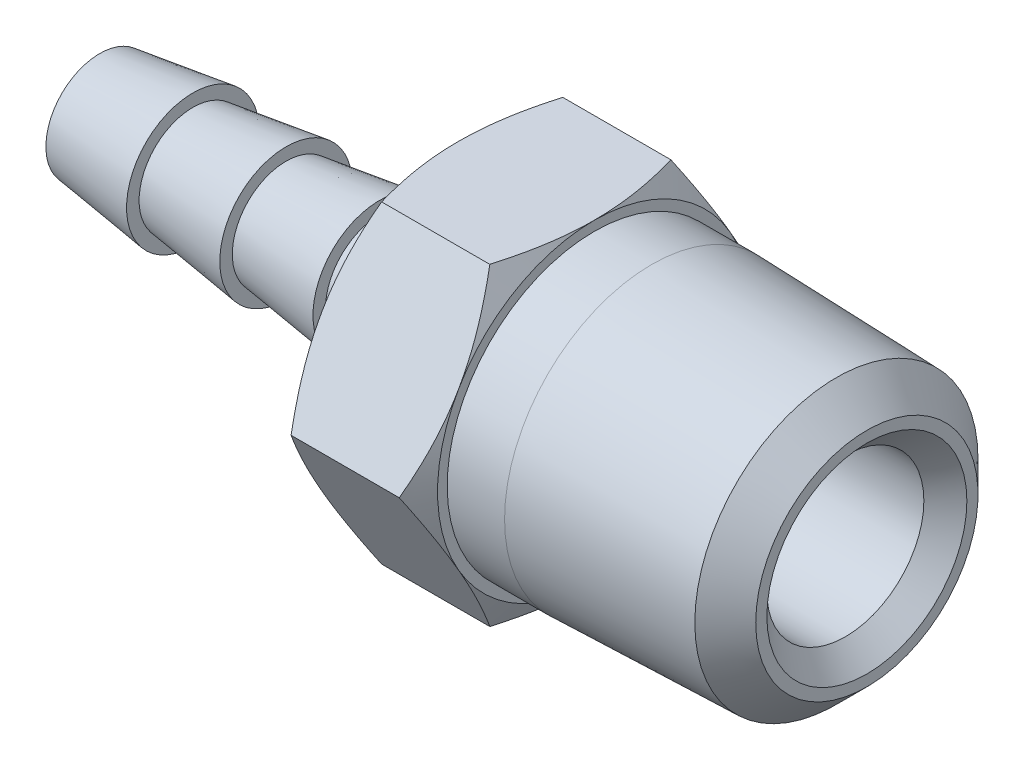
ISO-10303-21;
HEADER;
FILE_DESCRIPTION(('STEP AP214'),'2;1');
FILE_NAME('part.step','',(''),(''),'','','');
FILE_SCHEMA(('AUTOMOTIVE_DESIGN { 1 0 10303 214 1 1 1 1 }'));
ENDSEC;
DATA;
#1=APPLICATION_CONTEXT('core data for automotive mechanical design processes');
#2=APPLICATION_PROTOCOL_DEFINITION('international standard','automotive_design',2000,#1);
#3=PRODUCT_CONTEXT('',#1,'mechanical');
#4=PRODUCT('Part','Part','',(#3));
#5=PRODUCT_RELATED_PRODUCT_CATEGORY('part','',(#4));
#6=PRODUCT_DEFINITION_FORMATION('','',#4);
#7=PRODUCT_DEFINITION_CONTEXT('part definition',#1,'design');
#8=PRODUCT_DEFINITION('design','',#6,#7);
#9=PRODUCT_DEFINITION_SHAPE('','',#8);
#10=(LENGTH_UNIT() NAMED_UNIT(*) SI_UNIT(.MILLI.,.METRE.));
#11=(NAMED_UNIT(*) PLANE_ANGLE_UNIT() SI_UNIT($,.RADIAN.));
#12=(NAMED_UNIT(*) SI_UNIT($,.STERADIAN.) SOLID_ANGLE_UNIT());
#13=UNCERTAINTY_MEASURE_WITH_UNIT(LENGTH_MEASURE(1.E-05),#10,'distance_accuracy_value','');
#14=(GEOMETRIC_REPRESENTATION_CONTEXT(3) GLOBAL_UNCERTAINTY_ASSIGNED_CONTEXT((#13)) GLOBAL_UNIT_ASSIGNED_CONTEXT((#10,
#11,#12)) REPRESENTATION_CONTEXT('',''));
#15=CARTESIAN_POINT('',(0.,0.,0.));
#16=DIRECTION('',(0.,0.,1.));
#17=DIRECTION('',(1.,0.,0.));
#18=AXIS2_PLACEMENT_3D('',#15,#16,#17);
#19=CARTESIAN_POINT('',(6.60399999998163,0.,0.));
#20=DIRECTION('',(1.,0.,0.));
#21=DIRECTION('',(0.,0.,-1.));
#22=AXIS2_PLACEMENT_3D('',#19,#20,#21);
#23=CONICAL_SURFACE('',#22,2.34949999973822,0.133810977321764);
#24=CARTESIAN_POINT('',(3.30199999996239,0.,0.));
#25=DIRECTION('',(1.,0.,0.));
#26=DIRECTION('',(0.,0.,-1.));
#27=AXIS2_PLACEMENT_3D('',#24,#25,#26);
#28=CIRCLE('',#27,1.9050000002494);
#29=CARTESIAN_POINT('',(3.30199999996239,0.,-1.9050000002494));
#30=VERTEX_POINT('',#29);
#31=EDGE_CURVE('E499',#30,#30,#28,.F.);
#32=ORIENTED_EDGE('',*,*,#31,.F.);
#33=EDGE_LOOP('',(#32));
#34=FACE_BOUND('',#33,.T.);
#35=CARTESIAN_POINT('',(6.60400000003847,0.,0.));
#36=DIRECTION('',(1.,0.,0.));
#37=DIRECTION('',(0.,0.,-1.));
#38=AXIS2_PLACEMENT_3D('',#35,#36,#37);
#39=CIRCLE('',#38,2.34949999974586);
#40=CARTESIAN_POINT('',(6.60400000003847,0.,-2.34949999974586));
#41=VERTEX_POINT('',#40);
#42=EDGE_CURVE('E18',#41,#41,#39,.T.);
#43=ORIENTED_EDGE('',*,*,#42,.F.);
#44=EDGE_LOOP('',(#43));
#45=FACE_BOUND('',#44,.T.);
#46=ADVANCED_FACE('F14',(#34,#45),#23,.T.);
#47=CARTESIAN_POINT('',(6.604,0.,1.17475));
#48=DIRECTION('',(1.,0.,0.));
#49=DIRECTION('',(0.,0.,-1.));
#50=AXIS2_PLACEMENT_3D('',#47,#48,#49);
#51=PLANE('',#50);
#52=CARTESIAN_POINT('',(6.60399999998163,0.,0.));
#53=DIRECTION('',(1.,0.,0.));
#54=DIRECTION('',(0.,0.,-1.));
#55=AXIS2_PLACEMENT_3D('',#52,#53,#54);
#56=CIRCLE('',#55,1.90500000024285);
#57=CARTESIAN_POINT('',(6.60399999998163,0.,-1.90500000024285));
#58=VERTEX_POINT('',#57);
#59=EDGE_CURVE('E497',#58,#58,#56,.T.);
#60=ORIENTED_EDGE('',*,*,#59,.F.);
#61=EDGE_LOOP('',(#60));
#62=FACE_BOUND('',#61,.T.);
#63=ORIENTED_EDGE('',*,*,#42,.T.);
#64=EDGE_LOOP('',(#63));
#65=FACE_BOUND('',#64,.T.);
#66=ADVANCED_FACE('F506',(#62,#65),#51,.T.);
#67=CARTESIAN_POINT('',(3.302,0.,1.17475));
#68=DIRECTION('',(1.,0.,0.));
#69=DIRECTION('',(0.,0.,-1.));
#70=AXIS2_PLACEMENT_3D('',#67,#68,#69);
#71=PLANE('',#70);
#72=ORIENTED_EDGE('',*,*,#31,.T.);
#73=EDGE_LOOP('',(#72));
#74=FACE_BOUND('',#73,.T.);
#75=CARTESIAN_POINT('',(3.30200000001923,0.,0.));
#76=DIRECTION('',(1.,0.,0.));
#77=DIRECTION('',(0.,0.,-1.));
#78=AXIS2_PLACEMENT_3D('',#75,#76,#77);
#79=CIRCLE('',#78,2.34949999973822);
#80=CARTESIAN_POINT('',(3.30200000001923,0.,-2.34949999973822));
#81=VERTEX_POINT('',#80);
#82=EDGE_CURVE('E494',#81,#81,#79,.F.);
#83=ORIENTED_EDGE('',*,*,#82,.F.);
#84=EDGE_LOOP('',(#83));
#85=FACE_BOUND('',#84,.T.);
#86=ADVANCED_FACE('F515',(#74,#85),#71,.T.);
#87=CARTESIAN_POINT('',(9.90600000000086,0.,0.));
#88=DIRECTION('',(1.,0.,0.));
#89=DIRECTION('',(0.,0.,-1.));
#90=AXIS2_PLACEMENT_3D('',#87,#88,#89);
#91=CONICAL_SURFACE('',#90,2.34949999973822,0.133810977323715);
#92=ORIENTED_EDGE('',*,*,#59,.T.);
#93=EDGE_LOOP('',(#92));
#94=FACE_BOUND('',#93,.T.);
#95=CARTESIAN_POINT('',(9.9060000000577,0.,0.));
#96=DIRECTION('',(1.,0.,0.));
#97=DIRECTION('',(0.,0.,-1.));
#98=AXIS2_PLACEMENT_3D('',#95,#96,#97);
#99=CIRCLE('',#98,2.34949999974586);
#100=CARTESIAN_POINT('',(9.9060000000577,0.,-2.34949999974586));
#101=VERTEX_POINT('',#100);
#102=EDGE_CURVE('E491',#101,#101,#99,.T.);
#103=ORIENTED_EDGE('',*,*,#102,.F.);
#104=EDGE_LOOP('',(#103));
#105=FACE_BOUND('',#104,.T.);
#106=ADVANCED_FACE('F679',(#94,#105),#91,.T.);
#107=CARTESIAN_POINT('',(3.30200000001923,0.,0.));
#108=DIRECTION('',(1.,0.,0.));
#109=DIRECTION('',(0.,0.,-1.));
#110=AXIS2_PLACEMENT_3D('',#107,#108,#109);
#111=CONICAL_SURFACE('',#110,2.34949999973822,0.133810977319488);
#112=CARTESIAN_POINT('',(-5.6843418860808E-11,0.,0.));
#113=DIRECTION('',(1.,0.,0.));
#114=DIRECTION('',(0.,0.,-1.));
#115=AXIS2_PLACEMENT_3D('',#112,#113,#114);
#116=CIRCLE('',#115,1.9050000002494);
#117=CARTESIAN_POINT('',(-5.6843418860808E-11,0.,-1.9050000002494));
#118=VERTEX_POINT('',#117);
#119=EDGE_CURVE('E488',#118,#118,#116,.F.);
#120=ORIENTED_EDGE('',*,*,#119,.F.);
#121=EDGE_LOOP('',(#120));
#122=FACE_BOUND('',#121,.T.);
#123=ORIENTED_EDGE('',*,*,#82,.T.);
#124=EDGE_LOOP('',(#123));
#125=FACE_BOUND('',#124,.T.);
#126=ADVANCED_FACE('F669',(#122,#125),#111,.T.);
#127=CARTESIAN_POINT('',(9.906,0.,1.17475));
#128=DIRECTION('',(1.,0.,0.));
#129=DIRECTION('',(0.,0.,-1.));
#130=AXIS2_PLACEMENT_3D('',#127,#128,#129);
#131=PLANE('',#130);
#132=CARTESIAN_POINT('',(9.90599999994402,0.,0.));
#133=DIRECTION('',(1.,0.,0.));
#134=DIRECTION('',(0.,0.,-1.));
#135=AXIS2_PLACEMENT_3D('',#132,#133,#134);
#136=CIRCLE('',#135,1.90500000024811);
#137=CARTESIAN_POINT('',(9.90599999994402,0.,-1.90500000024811));
#138=VERTEX_POINT('',#137);
#139=EDGE_CURVE('E485',#138,#138,#136,.T.);
#140=ORIENTED_EDGE('',*,*,#139,.F.);
#141=EDGE_LOOP('',(#140));
#142=FACE_BOUND('',#141,.T.);
#143=ORIENTED_EDGE('',*,*,#102,.T.);
#144=EDGE_LOOP('',(#143));
#145=FACE_BOUND('',#144,.T.);
#146=ADVANCED_FACE('F657',(#142,#145),#131,.T.);
#147=CARTESIAN_POINT('',(0.,0.,0.9525));
#148=DIRECTION('',(-1.,0.,0.));
#149=DIRECTION('',(0.,0.,1.));
#150=AXIS2_PLACEMENT_3D('',#147,#148,#149);
#151=PLANE('',#150);
#152=CARTESIAN_POINT('',(0.,0.,0.));
#153=DIRECTION('',(1.,0.,0.));
#154=DIRECTION('',(0.,0.,-1.));
#155=AXIS2_PLACEMENT_3D('',#152,#153,#154);
#156=CIRCLE('',#155,1.1811);
#157=CARTESIAN_POINT('',(0.,0.,-1.1811));
#158=VERTEX_POINT('',#157);
#159=EDGE_CURVE('E482',#158,#158,#156,.T.);
#160=ORIENTED_EDGE('',*,*,#159,.T.);
#161=EDGE_LOOP('',(#160));
#162=FACE_BOUND('',#161,.T.);
#163=ORIENTED_EDGE('',*,*,#119,.T.);
#164=EDGE_LOOP('',(#163));
#165=FACE_BOUND('',#164,.T.);
#166=ADVANCED_FACE('F644',(#162,#165),#151,.T.);
#167=CARTESIAN_POINT('',(12.6999999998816,0.,0.));
#168=DIRECTION('',(1.,0.,0.));
#169=DIRECTION('',(0.,0.,-1.));
#170=AXIS2_PLACEMENT_3D('',#167,#168,#169);
#171=CONICAL_SURFACE('',#170,2.34949999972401,0.157768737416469);
#172=CARTESIAN_POINT('',(12.7000000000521,0.,0.));
#173=DIRECTION('',(1.,0.,0.));
#174=DIRECTION('',(0.,0.,-1.));
#175=AXIS2_PLACEMENT_3D('',#172,#173,#174);
#176=CIRCLE('',#175,2.34949999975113);
#177=CARTESIAN_POINT('',(12.7000000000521,0.,-2.34949999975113));
#178=VERTEX_POINT('',#177);
#179=EDGE_CURVE('E359',#178,#178,#176,.F.);
#180=ORIENTED_EDGE('',*,*,#179,.T.);
#181=EDGE_LOOP('',(#180));
#182=FACE_BOUND('',#181,.T.);
#183=ORIENTED_EDGE('',*,*,#139,.T.);
#184=EDGE_LOOP('',(#183));
#185=FACE_BOUND('',#184,.T.);
#186=ADVANCED_FACE('F522',(#182,#185),#171,.T.);
#187=CARTESIAN_POINT('',(0.,0.,0.));
#188=DIRECTION('',(1.,0.,0.));
#189=DIRECTION('',(0.,0.,-1.));
#190=AXIS2_PLACEMENT_3D('',#187,#188,#189);
#191=CYLINDRICAL_SURFACE('',#190,1.1811);
#192=ORIENTED_EDGE('',*,*,#159,.F.);
#193=EDGE_LOOP('',(#192));
#194=FACE_BOUND('',#193,.T.);
#195=CARTESIAN_POINT('',(13.5165028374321,0.,0.));
#196=DIRECTION('',(1.,0.,0.));
#197=DIRECTION('',(0.,0.,-1.));
#198=AXIS2_PLACEMENT_3D('',#195,#196,#197);
#199=CIRCLE('',#198,1.1811);
#200=CARTESIAN_POINT('',(13.5165028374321,0.,-1.1811));
#201=VERTEX_POINT('',#200);
#202=EDGE_CURVE('E130',#201,#201,#199,.T.);
#203=ORIENTED_EDGE('',*,*,#202,.T.);
#204=EDGE_LOOP('',(#203));
#205=FACE_BOUND('',#204,.T.);
#206=ADVANCED_FACE('F520',(#194,#205),#191,.F.);
#207=CARTESIAN_POINT('',(12.7,0.,0.));
#208=DIRECTION('',(1.,0.,0.));
#209=DIRECTION('',(0.,0.,-1.));
#210=AXIS2_PLACEMENT_3D('',#207,#208,#209);
#211=PLANE('',#210);
#212=ORIENTED_EDGE('',*,*,#179,.F.);
#213=EDGE_LOOP('',(#212));
#214=FACE_BOUND('',#213,.T.);
#215=CARTESIAN_POINT('',(12.6999999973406,0.,0.));
#216=DIRECTION('',(1.,0.,0.));
#217=DIRECTION('',(0.,0.,-1.));
#218=AXIS2_PLACEMENT_3D('',#215,#216,#217);
#219=CIRCLE('',#218,5.55625000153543);
#220=CARTESIAN_POINT('',(12.6999999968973,-2.77812500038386,-4.81185365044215));
#221=VERTEX_POINT('',#220);
#222=CARTESIAN_POINT('',(12.6999999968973,2.77812500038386,-4.81185365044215));
#223=VERTEX_POINT('',#222);
#224=EDGE_CURVE('E463',#221,#223,#219,.T.);
#225=ORIENTED_EDGE('',*,*,#224,.F.);
#226=CARTESIAN_POINT('',(12.6999999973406,0.,0.));
#227=DIRECTION('',(1.,0.,0.));
#228=DIRECTION('',(0.,0.,-1.));
#229=AXIS2_PLACEMENT_3D('',#226,#227,#228);
#230=CIRCLE('',#229,5.55625000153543);
#231=CARTESIAN_POINT('',(12.6999999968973,-5.55625000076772,0.));
#232=VERTEX_POINT('',#231);
#233=EDGE_CURVE('E465',#232,#221,#230,.T.);
#234=ORIENTED_EDGE('',*,*,#233,.F.);
#235=CARTESIAN_POINT('',(12.6999999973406,0.,0.));
#236=DIRECTION('',(1.,0.,0.));
#237=DIRECTION('',(0.,0.,-1.));
#238=AXIS2_PLACEMENT_3D('',#235,#236,#237);
#239=CIRCLE('',#238,5.55625000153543);
#240=CARTESIAN_POINT('',(12.6999999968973,-2.77812500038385,4.81185365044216));
#241=VERTEX_POINT('',#240);
#242=EDGE_CURVE('E108',#241,#232,#239,.T.);
#243=ORIENTED_EDGE('',*,*,#242,.F.);
#244=CARTESIAN_POINT('',(12.6999999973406,0.,0.));
#245=DIRECTION('',(1.,0.,0.));
#246=DIRECTION('',(0.,0.,-1.));
#247=AXIS2_PLACEMENT_3D('',#244,#245,#246);
#248=CIRCLE('',#247,5.55625000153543);
#249=CARTESIAN_POINT('',(12.6999999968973,2.77812500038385,4.81185365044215));
#250=VERTEX_POINT('',#249);
#251=EDGE_CURVE('E104',#250,#241,#248,.T.);
#252=ORIENTED_EDGE('',*,*,#251,.F.);
#253=CARTESIAN_POINT('',(12.6999999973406,0.,0.));
#254=DIRECTION('',(1.,0.,0.));
#255=DIRECTION('',(0.,0.,-1.));
#256=AXIS2_PLACEMENT_3D('',#253,#254,#255);
#257=CIRCLE('',#256,5.55625000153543);
#258=CARTESIAN_POINT('',(12.6999999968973,5.55625000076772,0.));
#259=VERTEX_POINT('',#258);
#260=EDGE_CURVE('E101',#259,#250,#257,.T.);
#261=ORIENTED_EDGE('',*,*,#260,.F.);
#262=CARTESIAN_POINT('',(12.6999999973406,0.,0.));
#263=DIRECTION('',(1.,0.,0.));
#264=DIRECTION('',(0.,0.,-1.));
#265=AXIS2_PLACEMENT_3D('',#262,#263,#264);
#266=CIRCLE('',#265,5.55625000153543);
#267=EDGE_CURVE('E356',#223,#259,#266,.T.);
#268=ORIENTED_EDGE('',*,*,#267,.F.);
#269=EDGE_LOOP('',(#225,#234,#243,#252,#261,#268));
#270=FACE_BOUND('',#269,.T.);
#271=ADVANCED_FACE('F106',(#214,#270),#211,.F.);
#272=CARTESIAN_POINT('',(14.478,0.,0.));
#273=DIRECTION('',(1.,0.,0.));
#274=DIRECTION('',(0.,0.,-1.));
#275=AXIS2_PLACEMENT_3D('',#272,#273,#274);
#276=CONICAL_SURFACE('',#275,2.7813,1.02974425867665);
#277=CARTESIAN_POINT('',(14.478,0.,0.));
#278=DIRECTION('',(1.,0.,0.));
#279=DIRECTION('',(0.,0.,-1.));
#280=AXIS2_PLACEMENT_3D('',#277,#278,#279);
#281=CIRCLE('',#280,2.7813);
#282=CARTESIAN_POINT('',(14.478,0.,-2.7813));
#283=VERTEX_POINT('',#282);
#284=EDGE_CURVE('E353',#283,#283,#281,.T.);
#285=ORIENTED_EDGE('',*,*,#284,.T.);
#286=EDGE_LOOP('',(#285));
#287=FACE_BOUND('',#286,.T.);
#288=ORIENTED_EDGE('',*,*,#202,.F.);
#289=EDGE_LOOP('',(#288));
#290=FACE_BOUND('',#289,.T.);
#291=ADVANCED_FACE('F161',(#287,#290),#276,.F.);
#292=CARTESIAN_POINT('',(13.199241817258,0.,0.));
#293=DIRECTION('',(1.,0.,0.));
#294=DIRECTION('',(0.,0.,-1.));
#295=AXIS2_PLACEMENT_3D('',#292,#293,#294);
#296=CONICAL_SURFACE('',#295,6.42096219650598,1.04719755);
#297=CARTESIAN_POINT('',(12.6999999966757,5.55624999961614,0.));
#298=CARTESIAN_POINT('',(12.6999772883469,5.55624999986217,0.136157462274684));
#299=CARTESIAN_POINT('',(12.7028890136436,5.55624999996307,0.27230836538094));
#300=CARTESIAN_POINT('',(12.714412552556,5.55625000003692,0.544342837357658));
#301=CARTESIAN_POINT('',(12.7230232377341,5.55625000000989,0.68022645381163));
#302=CARTESIAN_POINT('',(12.7457192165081,5.55624999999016,0.950848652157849));
#303=CARTESIAN_POINT('',(12.7597769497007,5.55624999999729,1.08558956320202));
#304=CARTESIAN_POINT('',(12.7930646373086,5.55625000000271,1.35442943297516));
#305=CARTESIAN_POINT('',(12.8122947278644,5.55625000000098,1.48852837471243));
#306=CARTESIAN_POINT('',(12.8771494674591,5.55624999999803,1.88930639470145));
#307=CARTESIAN_POINT('',(12.9299700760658,5.55624999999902,2.1548211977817));
#308=CARTESIAN_POINT('',(13.0517879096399,5.55625000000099,2.68356749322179));
#309=CARTESIAN_POINT('',(13.120865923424,5.55625000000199,2.94678054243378));
#310=CARTESIAN_POINT('',(13.1962642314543,5.55625,3.2079024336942));
#311=B_SPLINE_CURVE_WITH_KNOTS('',3,(#297,#298,#299,#300,#301,#302,#303,#304,#305,#306,#307,
#308,#309,#310),.UNSPECIFIED.,.F.,.F.,(4,2,2,2,2,2,4),(0.,0.408430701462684,0.816780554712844,
1.22309070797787,1.62941155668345,2.44098829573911,3.25668653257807),.UNSPECIFIED.);
#312=CARTESIAN_POINT('',(13.1962642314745,5.55625000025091,3.20790243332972));
#313=VERTEX_POINT('',#312);
#314=EDGE_CURVE('E121',#259,#313,#311,.T.);
#315=ORIENTED_EDGE('',*,*,#314,.F.);
#316=ORIENTED_EDGE('',*,*,#260,.T.);
#317=CARTESIAN_POINT('',(13.1962642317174,5.55625000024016,3.20790243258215));
#318=CARTESIAN_POINT('',(13.1208659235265,5.33011180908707,3.3384633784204));
#319=CARTESIAN_POINT('',(13.0517879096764,5.10216262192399,3.47006990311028));
#320=CARTESIAN_POINT('',(12.9299700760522,4.64425489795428,3.73444305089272));
#321=CARTESIAN_POINT('',(12.8771494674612,4.41431233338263,3.86720045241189));
#322=CARTESIAN_POINT('',(12.8122947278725,4.06722838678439,4.06758946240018));
#323=CARTESIAN_POINT('',(12.793064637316,3.95109529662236,4.13463893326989));
#324=CARTESIAN_POINT('',(12.7597769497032,3.71827313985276,4.2690588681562));
#325=CARTESIAN_POINT('',(12.7457192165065,3.60158408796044,4.33642932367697));
#326=CARTESIAN_POINT('',(12.7230232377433,3.36721838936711,4.47174042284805));
#327=CARTESIAN_POINT('',(12.7144125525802,3.24953972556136,4.53968223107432));
#328=CARTESIAN_POINT('',(12.7028890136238,3.01395096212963,4.67569946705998));
#329=CARTESIAN_POINT('',(12.699977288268,2.89604082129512,4.74377491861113));
#330=CARTESIAN_POINT('',(12.6999999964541,2.7781250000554,4.8118536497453));
#331=B_SPLINE_CURVE_WITH_KNOTS('',3,(#317,#318,#319,#320,#321,#322,#323,#324,#325,#326,#327,
#328,#329,#330),.UNSPECIFIED.,.F.,.F.,(4,2,2,2,2,2,4),(0.,0.815698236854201,1.62727497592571,
2.03359582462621,2.4399059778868,2.84825583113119,3.2566865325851),.UNSPECIFIED.);
#332=EDGE_CURVE('E127',#313,#250,#331,.T.);
#333=ORIENTED_EDGE('',*,*,#332,.F.);
#334=EDGE_LOOP('',(#315,#316,#333));
#335=FACE_BOUND('',#334,.T.);
#336=ADVANCED_FACE('F126',(#335),#296,.T.);
#337=CARTESIAN_POINT('',(13.199241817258,0.,0.));
#338=DIRECTION('',(1.,0.,0.));
#339=DIRECTION('',(0.,0.,-1.));
#340=AXIS2_PLACEMENT_3D('',#337,#338,#339);
#341=CONICAL_SURFACE('',#340,6.42096219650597,1.04719755);
#342=CARTESIAN_POINT('',(12.6999999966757,2.77812499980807,4.81185364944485));
#343=CARTESIAN_POINT('',(12.6999772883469,2.66020917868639,4.87993238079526));
#344=CARTESIAN_POINT('',(12.7028890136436,2.54229903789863,4.94800783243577));
#345=CARTESIAN_POINT('',(12.714412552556,2.30671027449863,5.08402506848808));
#346=CARTESIAN_POINT('',(12.7230232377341,2.18903161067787,5.15196687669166));
#347=CARTESIAN_POINT('',(12.7457192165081,1.95466591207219,5.28727797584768));
#348=CARTESIAN_POINT('',(12.7597769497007,1.83797686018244,5.35464843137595));
#349=CARTESIAN_POINT('',(12.7930646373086,1.60515470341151,5.48906836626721));
#350=CARTESIAN_POINT('',(12.8122947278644,1.48902161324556,5.55611783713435));
#351=CARTESIAN_POINT('',(12.8771494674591,1.14193766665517,5.7565068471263));
#352=CARTESIAN_POINT('',(12.9299700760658,0.911995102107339,5.88926424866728));
#353=CARTESIAN_POINT('',(13.0517879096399,0.454087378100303,6.15363739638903));
#354=CARTESIAN_POINT('',(13.120865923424,0.226138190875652,6.28524392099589));
#355=CARTESIAN_POINT('',(13.1962642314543,-4.41106867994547E-10,6.41580486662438));
#356=B_SPLINE_CURVE_WITH_KNOTS('',3,(#342,#343,#344,#345,#346,#347,#348,#349,#350,#351,#352,
#353,#354,#355),.UNSPECIFIED.,.F.,.F.,(4,2,2,2,2,2,4),(0.,0.408430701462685,0.816780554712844,
1.22309070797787,1.62941155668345,2.44098829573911,3.25668653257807),.UNSPECIFIED.);
#357=CARTESIAN_POINT('',(13.1962642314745,0.,6.41580486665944));
#358=VERTEX_POINT('',#357);
#359=EDGE_CURVE('E114',#250,#358,#356,.T.);
#360=ORIENTED_EDGE('',*,*,#359,.F.);
#361=ORIENTED_EDGE('',*,*,#251,.T.);
#362=CARTESIAN_POINT('',(13.1962642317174,6.4203040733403E-10,6.41580486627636));
#363=CARTESIAN_POINT('',(13.1208659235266,-0.226138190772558,6.28524392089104));
#364=CARTESIAN_POINT('',(13.0517879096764,-0.454087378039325,6.15363739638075));
#365=CARTESIAN_POINT('',(12.9299700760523,-0.911995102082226,5.88926424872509));
#366=CARTESIAN_POINT('',(12.8771494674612,-1.14193766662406,5.75650684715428));
#367=CARTESIAN_POINT('',(12.8122947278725,-1.48902161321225,5.55611783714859));
#368=CARTESIAN_POINT('',(12.793064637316,-1.60515470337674,5.48906836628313));
#369=CARTESIAN_POINT('',(12.7597769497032,-1.83797686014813,5.35464843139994));
#370=CARTESIAN_POINT('',(12.7457192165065,-1.95466591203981,5.28727797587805));
#371=CARTESIAN_POINT('',(12.7230232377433,-2.18903161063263,5.15196687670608));
#372=CARTESIAN_POINT('',(12.7144125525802,-2.3067102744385,5.08402506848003));
#373=CARTESIAN_POINT('',(12.7028890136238,-2.54229903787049,4.94800783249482));
#374=CARTESIAN_POINT('',(12.699977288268,-2.66020917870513,4.8799323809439));
#375=CARTESIAN_POINT('',(12.6999999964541,-2.77812499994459,4.81185364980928));
#376=B_SPLINE_CURVE_WITH_KNOTS('',3,(#362,#363,#364,#365,#366,#367,#368,#369,#370,#371,#372,
#373,#374,#375),.UNSPECIFIED.,.F.,.F.,(4,2,2,2,2,2,4),(0.,0.815698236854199,1.62727497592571,
2.0335958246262,2.43990597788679,2.84825583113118,3.2566865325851),.UNSPECIFIED.);
#377=EDGE_CURVE('E116',#358,#241,#376,.T.);
#378=ORIENTED_EDGE('',*,*,#377,.F.);
#379=EDGE_LOOP('',(#360,#361,#378));
#380=FACE_BOUND('',#379,.T.);
#381=ADVANCED_FACE('F115',(#380),#341,.T.);
#382=CARTESIAN_POINT('',(13.199241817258,0.,0.));
#383=DIRECTION('',(1.,0.,0.));
#384=DIRECTION('',(0.,0.,-1.));
#385=AXIS2_PLACEMENT_3D('',#382,#383,#384);
#386=CONICAL_SURFACE('',#385,6.42096219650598,1.04719755);
#387=CARTESIAN_POINT('',(12.6999999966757,-2.77812499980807,4.81185364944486));
#388=CARTESIAN_POINT('',(12.6999772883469,-2.89604082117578,4.74377491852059));
#389=CARTESIAN_POINT('',(12.7028890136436,-3.01395096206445,4.67569946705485));
#390=CARTESIAN_POINT('',(12.7144125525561,-3.24953972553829,4.53968223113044));
#391=CARTESIAN_POINT('',(12.7230232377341,-3.36721838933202,4.47174042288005));
#392=CARTESIAN_POINT('',(12.7457192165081,-3.60158408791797,4.33642932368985));
#393=CARTESIAN_POINT('',(12.7597769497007,-3.71827313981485,4.26905886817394));
#394=CARTESIAN_POINT('',(12.7930646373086,-3.9510952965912,4.13463893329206));
#395=CARTESIAN_POINT('',(12.8122947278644,-4.06722838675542,4.06758946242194));
#396=CARTESIAN_POINT('',(12.8771494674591,-4.41431233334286,3.86720045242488));
#397=CARTESIAN_POINT('',(12.9299700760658,-4.64425489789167,3.7344430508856));
#398=CARTESIAN_POINT('',(13.0517879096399,-5.10216262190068,3.47006990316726));
#399=CARTESIAN_POINT('',(13.120865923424,-5.33011180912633,3.33846337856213));
#400=CARTESIAN_POINT('',(13.1962642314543,-5.5562500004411,3.2079024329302));
#401=B_SPLINE_CURVE_WITH_KNOTS('',3,(#387,#388,#389,#390,#391,#392,#393,#394,#395,#396,#397,
#398,#399,#400),.UNSPECIFIED.,.F.,.F.,(4,2,2,2,2,2,4),(0.,0.408430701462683,0.816780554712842,
1.22309070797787,1.62941155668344,2.4409882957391,3.25668653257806),.UNSPECIFIED.);
#402=CARTESIAN_POINT('',(13.1962642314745,-5.55625000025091,3.20790243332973));
#403=VERTEX_POINT('',#402);
#404=EDGE_CURVE('E134',#241,#403,#401,.T.);
#405=ORIENTED_EDGE('',*,*,#404,.F.);
#406=ORIENTED_EDGE('',*,*,#242,.T.);
#407=CARTESIAN_POINT('',(13.1962642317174,-5.55624999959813,3.2079024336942));
#408=CARTESIAN_POINT('',(13.1208659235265,-5.55624999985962,2.94678054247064));
#409=CARTESIAN_POINT('',(13.0517879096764,-5.55624999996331,2.68356749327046));
#410=CARTESIAN_POINT('',(12.9299700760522,-5.55625000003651,2.15482119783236));
#411=CARTESIAN_POINT('',(12.8771494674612,-5.55625000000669,1.88930639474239));
#412=CARTESIAN_POINT('',(12.8122947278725,-5.55624999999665,1.4885283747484));
#413=CARTESIAN_POINT('',(12.793064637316,-5.5562499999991,1.35442943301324));
#414=CARTESIAN_POINT('',(12.7597769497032,-5.5562500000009,1.08558956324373));
#415=CARTESIAN_POINT('',(12.7457192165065,-5.55625000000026,0.950848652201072));
#416=CARTESIAN_POINT('',(12.7230232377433,-5.55624999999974,0.680226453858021));
#417=CARTESIAN_POINT('',(12.7144125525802,-5.55624999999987,0.544342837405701));
#418=CARTESIAN_POINT('',(12.7028890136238,-5.55625000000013,0.272308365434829));
#419=CARTESIAN_POINT('',(12.699977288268,-5.55625000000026,0.136157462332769));
#420=CARTESIAN_POINT('',(12.6999999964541,-5.55625,6.39774503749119E-11));
#421=B_SPLINE_CURVE_WITH_KNOTS('',3,(#407,#408,#409,#410,#411,#412,#413,#414,#415,#416,#417,
#418,#419,#420),.UNSPECIFIED.,.F.,.F.,(4,2,2,2,2,2,4),(0.,0.8156982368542,1.62727497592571,
2.03359582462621,2.4399059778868,2.84825583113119,3.25668653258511),.UNSPECIFIED.);
#422=EDGE_CURVE('E301',#403,#232,#421,.T.);
#423=ORIENTED_EDGE('',*,*,#422,.F.);
#424=EDGE_LOOP('',(#405,#406,#423));
#425=FACE_BOUND('',#424,.T.);
#426=ADVANCED_FACE('F309',(#425),#386,.T.);
#427=CARTESIAN_POINT('',(13.199241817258,0.,0.));
#428=DIRECTION('',(1.,0.,0.));
#429=DIRECTION('',(0.,0.,-1.));
#430=AXIS2_PLACEMENT_3D('',#427,#428,#429);
#431=CONICAL_SURFACE('',#430,6.42096219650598,1.04719755);
#432=ORIENTED_EDGE('',*,*,#233,.T.);
#433=CARTESIAN_POINT('',(13.1962642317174,-5.55625000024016,-3.20790243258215));
#434=CARTESIAN_POINT('',(13.1208659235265,-5.33011180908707,-3.3384633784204));
#435=CARTESIAN_POINT('',(13.0517879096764,-5.10216262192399,-3.47006990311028));
#436=CARTESIAN_POINT('',(12.9299700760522,-4.64425489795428,-3.73444305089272));
#437=CARTESIAN_POINT('',(12.8771494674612,-4.41431233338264,-3.86720045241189));
#438=CARTESIAN_POINT('',(12.8122947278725,-4.0672283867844,-4.06758946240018));
#439=CARTESIAN_POINT('',(12.793064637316,-3.95109529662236,-4.13463893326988));
#440=CARTESIAN_POINT('',(12.7597769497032,-3.71827313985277,-4.2690588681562));
#441=CARTESIAN_POINT('',(12.7457192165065,-3.60158408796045,-4.33642932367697));
#442=CARTESIAN_POINT('',(12.7230232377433,-3.36721838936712,-4.47174042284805));
#443=CARTESIAN_POINT('',(12.7144125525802,-3.24953972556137,-4.53968223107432));
#444=CARTESIAN_POINT('',(12.7028890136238,-3.01395096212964,-4.67569946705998));
#445=CARTESIAN_POINT('',(12.699977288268,-2.89604082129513,-4.74377491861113));
#446=CARTESIAN_POINT('',(12.6999999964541,-2.77812500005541,-4.8118536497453));
#447=B_SPLINE_CURVE_WITH_KNOTS('',3,(#433,#434,#435,#436,#437,#438,#439,#440,#441,#442,#443,
#444,#445,#446),.UNSPECIFIED.,.F.,.F.,(4,2,2,2,2,2,4),(0.,0.815698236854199,1.6272749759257,
2.0335958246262,2.43990597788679,2.84825583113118,3.2566865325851),.UNSPECIFIED.);
#448=CARTESIAN_POINT('',(13.1962642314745,-5.55625000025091,-3.20790243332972));
#449=VERTEX_POINT('',#448);
#450=EDGE_CURVE('E321',#449,#221,#447,.T.);
#451=ORIENTED_EDGE('',*,*,#450,.F.);
#452=CARTESIAN_POINT('',(12.6999999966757,-5.55624999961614,0.));
#453=CARTESIAN_POINT('',(12.6999772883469,-5.55624999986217,-0.136157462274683));
#454=CARTESIAN_POINT('',(12.7028890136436,-5.55624999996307,-0.272308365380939));
#455=CARTESIAN_POINT('',(12.714412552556,-5.55625000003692,-0.544342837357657));
#456=CARTESIAN_POINT('',(12.7230232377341,-5.55625000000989,-0.680226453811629));
#457=CARTESIAN_POINT('',(12.7457192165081,-5.55624999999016,-0.950848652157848));
#458=CARTESIAN_POINT('',(12.7597769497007,-5.55624999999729,-1.08558956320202));
#459=CARTESIAN_POINT('',(12.7930646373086,-5.55625000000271,-1.35442943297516));
#460=CARTESIAN_POINT('',(12.8122947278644,-5.55625000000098,-1.48852837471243));
#461=CARTESIAN_POINT('',(12.8771494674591,-5.55624999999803,-1.88930639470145));
#462=CARTESIAN_POINT('',(12.9299700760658,-5.55624999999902,-2.1548211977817));
#463=CARTESIAN_POINT('',(13.0517879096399,-5.55625000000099,-2.68356749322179));
#464=CARTESIAN_POINT('',(13.120865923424,-5.55625000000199,-2.94678054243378));
#465=CARTESIAN_POINT('',(13.1962642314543,-5.55625,-3.2079024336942));
#466=B_SPLINE_CURVE_WITH_KNOTS('',3,(#452,#453,#454,#455,#456,#457,#458,#459,#460,#461,#462,
#463,#464,#465),.UNSPECIFIED.,.F.,.F.,(4,2,2,2,2,2,4),(0.,0.408430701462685,0.816780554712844,
1.22309070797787,1.62941155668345,2.44098829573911,3.25668653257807),.UNSPECIFIED.);
#467=EDGE_CURVE('E293',#232,#449,#466,.T.);
#468=ORIENTED_EDGE('',*,*,#467,.F.);
#469=EDGE_LOOP('',(#432,#451,#468));
#470=FACE_BOUND('',#469,.T.);
#471=ADVANCED_FACE('F312',(#470),#431,.T.);
#472=CARTESIAN_POINT('',(13.199241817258,0.,0.));
#473=DIRECTION('',(1.,0.,0.));
#474=DIRECTION('',(0.,0.,-1.));
#475=AXIS2_PLACEMENT_3D('',#472,#473,#474);
#476=CONICAL_SURFACE('',#475,6.42096219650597,1.04719755);
#477=ORIENTED_EDGE('',*,*,#224,.T.);
#478=CARTESIAN_POINT('',(13.1962642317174,-6.42033591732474E-10,-6.41580486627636));
#479=CARTESIAN_POINT('',(13.1208659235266,0.226138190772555,-6.28524392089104));
#480=CARTESIAN_POINT('',(13.0517879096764,0.454087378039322,-6.15363739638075));
#481=CARTESIAN_POINT('',(12.9299700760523,0.911995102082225,-5.88926424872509));
#482=CARTESIAN_POINT('',(12.8771494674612,1.14193766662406,-5.75650684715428));
#483=CARTESIAN_POINT('',(12.8122947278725,1.48902161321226,-5.55611783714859));
#484=CARTESIAN_POINT('',(12.793064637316,1.60515470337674,-5.48906836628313));
#485=CARTESIAN_POINT('',(12.7597769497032,1.83797686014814,-5.35464843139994));
#486=CARTESIAN_POINT('',(12.7457192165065,1.95466591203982,-5.28727797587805));
#487=CARTESIAN_POINT('',(12.7230232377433,2.18903161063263,-5.15196687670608));
#488=CARTESIAN_POINT('',(12.7144125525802,2.30671027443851,-5.08402506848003));
#489=CARTESIAN_POINT('',(12.7028890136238,2.54229903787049,-4.94800783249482));
#490=CARTESIAN_POINT('',(12.699977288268,2.66020917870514,-4.8799323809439));
#491=CARTESIAN_POINT('',(12.6999999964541,2.7781249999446,-4.81185364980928));
#492=B_SPLINE_CURVE_WITH_KNOTS('',3,(#478,#479,#480,#481,#482,#483,#484,#485,#486,#487,#488,
#489,#490,#491),.UNSPECIFIED.,.F.,.F.,(4,2,2,2,2,2,4),(0.,0.8156982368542,1.62727497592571,
2.03359582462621,2.4399059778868,2.84825583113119,3.2566865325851),.UNSPECIFIED.);
#493=CARTESIAN_POINT('',(13.1962642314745,0.,-6.41580486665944));
#494=VERTEX_POINT('',#493);
#495=EDGE_CURVE('E334',#494,#223,#492,.T.);
#496=ORIENTED_EDGE('',*,*,#495,.F.);
#497=CARTESIAN_POINT('',(12.6999999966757,-2.77812499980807,-4.81185364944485));
#498=CARTESIAN_POINT('',(12.6999772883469,-2.66020917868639,-4.87993238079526));
#499=CARTESIAN_POINT('',(12.7028890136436,-2.54229903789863,-4.94800783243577));
#500=CARTESIAN_POINT('',(12.714412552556,-2.30671027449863,-5.08402506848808));
#501=CARTESIAN_POINT('',(12.7230232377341,-2.18903161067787,-5.15196687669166));
#502=CARTESIAN_POINT('',(12.7457192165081,-1.95466591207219,-5.28727797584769));
#503=CARTESIAN_POINT('',(12.7597769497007,-1.83797686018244,-5.35464843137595));
#504=CARTESIAN_POINT('',(12.7930646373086,-1.60515470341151,-5.48906836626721));
#505=CARTESIAN_POINT('',(12.8122947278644,-1.48902161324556,-5.55611783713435));
#506=CARTESIAN_POINT('',(12.8771494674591,-1.14193766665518,-5.7565068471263));
#507=CARTESIAN_POINT('',(12.9299700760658,-0.911995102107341,-5.88926424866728));
#508=CARTESIAN_POINT('',(13.0517879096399,-0.454087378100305,-6.15363739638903));
#509=CARTESIAN_POINT('',(13.120865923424,-0.226138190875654,-6.28524392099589));
#510=CARTESIAN_POINT('',(13.1962642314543,4.41104652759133E-10,-6.41580486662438));
#511=B_SPLINE_CURVE_WITH_KNOTS('',3,(#497,#498,#499,#500,#501,#502,#503,#504,#505,#506,#507,
#508,#509,#510),.UNSPECIFIED.,.F.,.F.,(4,2,2,2,2,2,4),(0.,0.408430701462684,0.816780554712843,
1.22309070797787,1.62941155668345,2.44098829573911,3.25668653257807),.UNSPECIFIED.);
#512=EDGE_CURVE('E327',#221,#494,#511,.T.);
#513=ORIENTED_EDGE('',*,*,#512,.F.);
#514=EDGE_LOOP('',(#477,#496,#513));
#515=FACE_BOUND('',#514,.T.);
#516=ADVANCED_FACE('F317',(#515),#476,.T.);
#517=CARTESIAN_POINT('',(13.199241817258,0.,0.));
#518=DIRECTION('',(1.,0.,0.));
#519=DIRECTION('',(0.,0.,-1.));
#520=AXIS2_PLACEMENT_3D('',#517,#518,#519);
#521=CONICAL_SURFACE('',#520,6.42096219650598,1.04719755);
#522=ORIENTED_EDGE('',*,*,#267,.T.);
#523=CARTESIAN_POINT('',(13.1962642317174,5.55624999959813,-3.2079024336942));
#524=CARTESIAN_POINT('',(13.1208659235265,5.55624999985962,-2.94678054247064));
#525=CARTESIAN_POINT('',(13.0517879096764,5.55624999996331,-2.68356749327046));
#526=CARTESIAN_POINT('',(12.9299700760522,5.55625000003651,-2.15482119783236));
#527=CARTESIAN_POINT('',(12.8771494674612,5.55625000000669,-1.88930639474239));
#528=CARTESIAN_POINT('',(12.8122947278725,5.55624999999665,-1.4885283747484));
#529=CARTESIAN_POINT('',(12.793064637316,5.5562499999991,-1.35442943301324));
#530=CARTESIAN_POINT('',(12.7597769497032,5.5562500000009,-1.08558956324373));
#531=CARTESIAN_POINT('',(12.7457192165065,5.55625000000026,-0.950848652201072));
#532=CARTESIAN_POINT('',(12.7230232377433,5.55624999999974,-0.680226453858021));
#533=CARTESIAN_POINT('',(12.7144125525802,5.55624999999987,-0.544342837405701));
#534=CARTESIAN_POINT('',(12.7028890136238,5.55625000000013,-0.272308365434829));
#535=CARTESIAN_POINT('',(12.699977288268,5.55625000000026,-0.136157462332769));
#536=CARTESIAN_POINT('',(12.6999999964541,5.55625,-6.39765830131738E-11));
#537=B_SPLINE_CURVE_WITH_KNOTS('',3,(#523,#524,#525,#526,#527,#528,#529,#530,#531,#532,#533,
#534,#535,#536),.UNSPECIFIED.,.F.,.F.,(4,2,2,2,2,2,4),(0.,0.815698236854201,1.62727497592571,
2.03359582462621,2.4399059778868,2.84825583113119,3.25668653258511),.UNSPECIFIED.);
#538=CARTESIAN_POINT('',(13.1962642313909,5.55625,-3.2079024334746));
#539=VERTEX_POINT('',#538);
#540=EDGE_CURVE('E169',#539,#259,#537,.T.);
#541=ORIENTED_EDGE('',*,*,#540,.F.);
#542=CARTESIAN_POINT('',(12.6999999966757,2.77812499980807,-4.81185364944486));
#543=CARTESIAN_POINT('',(12.6999772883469,2.89604082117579,-4.74377491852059));
#544=CARTESIAN_POINT('',(12.7028890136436,3.01395096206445,-4.67569946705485));
#545=CARTESIAN_POINT('',(12.7144125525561,3.2495397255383,-4.53968223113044));
#546=CARTESIAN_POINT('',(12.7230232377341,3.36721838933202,-4.47174042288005));
#547=CARTESIAN_POINT('',(12.7457192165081,3.60158408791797,-4.33642932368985));
#548=CARTESIAN_POINT('',(12.7597769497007,3.71827313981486,-4.26905886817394));
#549=CARTESIAN_POINT('',(12.7930646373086,3.9510952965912,-4.13463893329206));
#550=CARTESIAN_POINT('',(12.8122947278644,4.06722838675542,-4.06758946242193));
#551=CARTESIAN_POINT('',(12.8771494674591,4.41431233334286,-3.86720045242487));
#552=CARTESIAN_POINT('',(12.9299700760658,4.64425489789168,-3.73444305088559));
#553=CARTESIAN_POINT('',(13.0517879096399,5.10216262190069,-3.47006990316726));
#554=CARTESIAN_POINT('',(13.120865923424,5.33011180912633,-3.33846337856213));
#555=CARTESIAN_POINT('',(13.1962642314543,5.5562500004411,-3.2079024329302));
#556=B_SPLINE_CURVE_WITH_KNOTS('',3,(#542,#543,#544,#545,#546,#547,#548,#549,#550,#551,#552,
#553,#554,#555),.UNSPECIFIED.,.F.,.F.,(4,2,2,2,2,2,4),(0.,0.408430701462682,0.816780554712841,
1.22309070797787,1.62941155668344,2.4409882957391,3.25668653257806),.UNSPECIFIED.);
#557=EDGE_CURVE('E208',#223,#539,#556,.T.);
#558=ORIENTED_EDGE('',*,*,#557,.F.);
#559=EDGE_LOOP('',(#522,#541,#558));
#560=FACE_BOUND('',#559,.T.);
#561=ADVANCED_FACE('F179',(#560),#521,.T.);
#562=CARTESIAN_POINT('',(26.416,0.,0.));
#563=DIRECTION('',(-1.,0.,0.));
#564=DIRECTION('',(0.,0.,1.));
#565=AXIS2_PLACEMENT_3D('',#562,#563,#564);
#566=CYLINDRICAL_SURFACE('',#565,2.7813);
#567=CARTESIAN_POINT('',(26.4159999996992,0.,0.));
#568=DIRECTION('',(1.,0.,0.));
#569=DIRECTION('',(0.,-1.,0.));
#570=AXIS2_PLACEMENT_3D('',#567,#568,#569);
#571=CIRCLE('',#570,2.78130000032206);
#572=CARTESIAN_POINT('',(26.4159999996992,-2.78130000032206,0.));
#573=VERTEX_POINT('',#572);
#574=EDGE_CURVE('E203',#573,#573,#571,.T.);
#575=ORIENTED_EDGE('',*,*,#574,.T.);
#576=EDGE_LOOP('',(#575));
#577=FACE_BOUND('',#576,.T.);
#578=ORIENTED_EDGE('',*,*,#284,.F.);
#579=EDGE_LOOP('',(#578));
#580=FACE_BOUND('',#579,.T.);
#581=ADVANCED_FACE('F16',(#577,#580),#566,.F.);
#582=CARTESIAN_POINT('',(12.7,5.55625,3.20790243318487));
#583=DIRECTION('',(0.,1.,0.));
#584=DIRECTION('',(0.,0.,1.));
#585=AXIS2_PLACEMENT_3D('',#582,#583,#584);
#586=PLANE('',#585);
#587=CARTESIAN_POINT('',(17.0297357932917,5.55624999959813,-3.20790234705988));
#588=CARTESIAN_POINT('',(17.1051340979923,5.55624999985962,-2.94678046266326));
#589=CARTESIAN_POINT('',(17.1742121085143,5.55624999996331,-2.68356742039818));
#590=CARTESIAN_POINT('',(17.2960299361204,5.55625000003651,-2.15482113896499));
#591=CARTESIAN_POINT('',(17.3488505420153,5.55625000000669,-1.88930634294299));
#592=CARTESIAN_POINT('',(17.4137052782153,5.55624999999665,-1.48852833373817));
#593=CARTESIAN_POINT('',(17.4329353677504,5.5562499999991,-1.35442939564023));
#594=CARTESIAN_POINT('',(17.4662230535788,5.5562500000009,-1.08558953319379));
#595=CARTESIAN_POINT('',(17.4802807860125,5.55625000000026,-0.950848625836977));
#596=CARTESIAN_POINT('',(17.5029767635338,5.55624999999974,-0.680226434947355));
#597=CARTESIAN_POINT('',(17.5115874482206,5.55624999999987,-0.544342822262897));
#598=CARTESIAN_POINT('',(17.5231109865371,5.55625000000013,-0.272308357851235));
#599=CARTESIAN_POINT('',(17.5260227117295,5.55625000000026,-0.136157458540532));
#600=CARTESIAN_POINT('',(17.526000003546,5.55625,-6.39761678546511E-11));
#601=B_SPLINE_CURVE_WITH_KNOTS('',3,(#587,#588,#589,#590,#591,#592,#593,#594,#595,#596,#597,
#598,#599,#600),.UNSPECIFIED.,.F.,.F.,(4,2,2,2,2,2,4),(0.,0.815698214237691,1.6272749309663,
2.03359576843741,2.4399059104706,2.84825575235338,3.25668644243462),.UNSPECIFIED.);
#602=CARTESIAN_POINT('',(17.0297357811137,5.55625,-3.20790239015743));
#603=VERTEX_POINT('',#602);
#604=CARTESIAN_POINT('',(17.5260000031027,5.55625000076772,0.));
#605=VERTEX_POINT('',#604);
#606=EDGE_CURVE('E194',#603,#605,#601,.T.);
#607=ORIENTED_EDGE('',*,*,#606,.F.);
#608=DIRECTION('',(1.,0.,0.));
#609=VECTOR('',#608,1.);
#610=CARTESIAN_POINT('',(12.7,5.55625,-3.20790243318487));
#611=LINE('',#610,#609);
#612=EDGE_CURVE('E341',#539,#603,#611,.T.);
#613=ORIENTED_EDGE('',*,*,#612,.F.);
#614=ORIENTED_EDGE('',*,*,#540,.T.);
#615=ORIENTED_EDGE('',*,*,#314,.T.);
#616=DIRECTION('',(1.,0.,0.));
#617=VECTOR('',#616,1.);
#618=CARTESIAN_POINT('',(12.7,5.55625,3.20790243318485));
#619=LINE('',#618,#617);
#620=CARTESIAN_POINT('',(17.0297357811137,5.55624996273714,3.20790245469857));
#621=VERTEX_POINT('',#620);
#622=EDGE_CURVE('E120',#621,#313,#619,.F.);
#623=ORIENTED_EDGE('',*,*,#622,.F.);
#624=CARTESIAN_POINT('',(17.5260000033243,5.55624999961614,0.));
#625=CARTESIAN_POINT('',(17.5260227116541,5.55624999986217,0.136157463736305));
#626=CARTESIAN_POINT('',(17.5231109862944,5.55624999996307,0.272308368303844));
#627=CARTESIAN_POINT('',(17.5115874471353,5.55625000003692,0.544342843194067));
#628=CARTESIAN_POINT('',(17.5029767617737,5.55625000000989,0.680226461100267));
#629=CARTESIAN_POINT('',(17.480280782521,5.55624999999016,0.950848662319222));
#630=CARTESIAN_POINT('',(17.4662230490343,5.55624999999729,1.08558957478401));
#631=CARTESIAN_POINT('',(17.4329353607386,5.55625000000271,1.35442944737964));
#632=CARTESIAN_POINT('',(17.4137052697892,5.55625000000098,1.48852839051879));
#633=CARTESIAN_POINT('',(17.3488505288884,5.55624999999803,1.88930641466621));
#634=CARTESIAN_POINT('',(17.2960299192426,5.55624999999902,2.15482122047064));
#635=CARTESIAN_POINT('',(17.174212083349,5.55625000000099,2.68356752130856));
#636=CARTESIAN_POINT('',(17.1051340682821,5.55625000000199,2.94678057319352));
#637=CARTESIAN_POINT('',(17.0297357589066,5.55625,3.2079024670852));
#638=B_SPLINE_CURVE_WITH_KNOTS('',3,(#624,#625,#626,#627,#628,#629,#630,#631,#632,#633,#634,
#635,#636,#637),.UNSPECIFIED.,.F.,.F.,(4,2,2,2,2,2,4),(0.,0.408430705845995,0.816780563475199,
1.22309072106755,1.6294115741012,2.44098832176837,3.25668656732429),.UNSPECIFIED.);
#639=EDGE_CURVE('E186',#605,#621,#638,.T.);
#640=ORIENTED_EDGE('',*,*,#639,.F.);
#641=EDGE_LOOP('',(#607,#613,#614,#615,#623,#640));
#642=FACE_BOUND('',#641,.T.);
#643=ADVANCED_FACE('F175',(#642),#586,.T.);
#644=CARTESIAN_POINT('',(12.7,0.,6.41580486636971));
#645=DIRECTION('',(0.,0.5,0.866025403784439));
#646=DIRECTION('',(0.,-0.866025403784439,0.5));
#647=AXIS2_PLACEMENT_3D('',#644,#645,#646);
#648=PLANE('',#647);
#649=ORIENTED_EDGE('',*,*,#622,.T.);
#650=ORIENTED_EDGE('',*,*,#332,.T.);
#651=ORIENTED_EDGE('',*,*,#359,.T.);
#652=DIRECTION('',(1.,0.,0.));
#653=VECTOR('',#652,1.);
#654=CARTESIAN_POINT('',(12.7,0.,6.41580486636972));
#655=LINE('',#654,#653);
#656=CARTESIAN_POINT('',(17.0297357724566,-1.12917933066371E-08,6.4158048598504));
#657=VERTEX_POINT('',#656);
#658=EDGE_CURVE('E137',#657,#358,#655,.F.);
#659=ORIENTED_EDGE('',*,*,#658,.F.);
#660=CARTESIAN_POINT('',(17.5260000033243,2.77812499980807,4.81185364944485));
#661=CARTESIAN_POINT('',(17.5260227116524,2.66020917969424,4.87993238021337));
#662=CARTESIAN_POINT('',(17.5231109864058,2.54229903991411,4.94800783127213));
#663=CARTESIAN_POINT('',(17.5115874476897,2.30671027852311,5.08402506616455));
#664=CARTESIAN_POINT('',(17.5029767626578,2.18903161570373,5.15196687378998));
#665=CARTESIAN_POINT('',(17.4802807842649,1.95466591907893,5.28727797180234));
#666=CARTESIAN_POINT('',(17.4662230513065,1.83797686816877,5.35464842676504));
#667=CARTESIAN_POINT('',(17.4329353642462,1.60515471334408,5.48906836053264));
#668=CARTESIAN_POINT('',(17.4137052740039,1.48902162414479,5.55611783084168));
#669=CARTESIAN_POINT('',(17.3488505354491,1.14193768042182,5.75650683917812));
#670=CARTESIAN_POINT('',(17.2960299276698,0.911995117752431,5.88926423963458));
#671=CARTESIAN_POINT('',(17.1742120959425,0.454087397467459,6.1536373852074));
#672=CARTESIAN_POINT('',(17.1051340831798,0.226138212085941,6.28524390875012));
#673=CARTESIAN_POINT('',(17.0297357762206,2.25835675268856E-08,6.41580485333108));
#674=B_SPLINE_CURVE_WITH_KNOTS('',3,(#660,#661,#662,#663,#664,#665,#666,#667,#668,#669,#670,
#671,#672,#673),.UNSPECIFIED.,.F.,.F.,(4,2,2,2,2,2,4),(0.,0.408430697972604,0.816780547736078,
1.22309069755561,1.62941154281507,2.44098827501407,3.25668650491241),.UNSPECIFIED.);
#675=CARTESIAN_POINT('',(17.5260000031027,2.77812500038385,4.81185365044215));
#676=VERTEX_POINT('',#675);
#677=EDGE_CURVE('E418',#676,#657,#674,.T.);
#678=ORIENTED_EDGE('',*,*,#677,.F.);
#679=CARTESIAN_POINT('',(17.0297357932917,5.55624992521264,3.20790247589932));
#680=CARTESIAN_POINT('',(17.1051340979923,5.33011173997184,3.33846341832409));
#681=CARTESIAN_POINT('',(17.1742121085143,5.10216255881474,3.47006993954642));
#682=CARTESIAN_POINT('',(17.2960299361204,4.64425484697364,3.7344430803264));
#683=CARTESIAN_POINT('',(17.3488505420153,4.41431228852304,3.86720047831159));
#684=CARTESIAN_POINT('',(17.4137052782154,4.06722835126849,4.0675894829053));
#685=CARTESIAN_POINT('',(17.4329353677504,3.95109526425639,4.13463895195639));
#686=CARTESIAN_POINT('',(17.4662230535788,3.71827311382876,4.26905888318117));
#687=CARTESIAN_POINT('',(17.4802807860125,3.60158406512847,4.33642933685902));
#688=CARTESIAN_POINT('',(17.5029767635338,3.36721837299,4.47174043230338));
#689=CARTESIAN_POINT('',(17.5115874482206,3.24953971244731,4.53968223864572));
#690=CARTESIAN_POINT('',(17.5231109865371,3.01395095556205,4.67569947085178));
#691=CARTESIAN_POINT('',(17.5260227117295,2.89604081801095,4.74377492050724));
#692=CARTESIAN_POINT('',(17.526000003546,2.7781250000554,4.8118536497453));
#693=B_SPLINE_CURVE_WITH_KNOTS('',3,(#679,#680,#681,#682,#683,#684,#685,#686,#687,#688,#689,
#690,#691,#692),.UNSPECIFIED.,.F.,.F.,(4,2,2,2,2,2,4),(0.,0.815698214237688,1.6272749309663,
2.03359576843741,2.43990591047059,2.84825575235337,3.25668644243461),.UNSPECIFIED.);
#694=EDGE_CURVE('E408',#621,#676,#693,.T.);
#695=ORIENTED_EDGE('',*,*,#694,.F.);
#696=EDGE_LOOP('',(#649,#650,#651,#659,#678,#695));
#697=FACE_BOUND('',#696,.T.);
#698=ADVANCED_FACE('F132',(#697),#648,.T.);
#699=CARTESIAN_POINT('',(12.7,-5.55625,3.20790243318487));
#700=DIRECTION('',(0.,-0.5,0.866025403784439));
#701=DIRECTION('',(0.,-0.866025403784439,-0.5));
#702=AXIS2_PLACEMENT_3D('',#699,#700,#701);
#703=PLANE('',#702);
#704=ORIENTED_EDGE('',*,*,#658,.T.);
#705=ORIENTED_EDGE('',*,*,#377,.T.);
#706=ORIENTED_EDGE('',*,*,#404,.T.);
#707=DIRECTION('',(1.,0.,0.));
#708=VECTOR('',#707,1.);
#709=CARTESIAN_POINT('',(12.7,-5.55625,3.20790243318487));
#710=LINE('',#709,#708);
#711=CARTESIAN_POINT('',(17.0297357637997,-5.55625,3.20790245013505));
#712=VERTEX_POINT('',#711);
#713=EDGE_CURVE('E328',#712,#403,#710,.F.);
#714=ORIENTED_EDGE('',*,*,#713,.F.);
#715=CARTESIAN_POINT('',(17.5260000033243,-2.77812499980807,4.81185364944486));
#716=CARTESIAN_POINT('',(17.5260227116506,-2.89604081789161,4.7437749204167));
#717=CARTESIAN_POINT('',(17.5231109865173,-3.01395095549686,4.67569947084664));
#718=CARTESIAN_POINT('',(17.5115874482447,-3.24953971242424,4.53968223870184));
#719=CARTESIAN_POINT('',(17.5029767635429,-3.3672183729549,4.47174043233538));
#720=CARTESIAN_POINT('',(17.4802807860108,-3.60158406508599,4.3364293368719));
#721=CARTESIAN_POINT('',(17.4662230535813,-3.71827311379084,4.26905888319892));
#722=CARTESIAN_POINT('',(17.4329353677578,-3.95109526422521,4.13463895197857));
#723=CARTESIAN_POINT('',(17.4137052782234,-4.06722835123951,4.06758948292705));
#724=CARTESIAN_POINT('',(17.3488505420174,-4.41431228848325,3.86720047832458));
#725=CARTESIAN_POINT('',(17.2960299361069,-4.64425484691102,3.73444308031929));
#726=CARTESIAN_POINT('',(17.1742121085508,-5.10216255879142,3.47006993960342));
#727=CARTESIAN_POINT('',(17.1051340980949,-5.33011174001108,3.33846341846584));
#728=CARTESIAN_POINT('',(17.0297357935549,-5.55624992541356,3.20790247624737));
#729=B_SPLINE_CURVE_WITH_KNOTS('',3,(#715,#716,#717,#718,#719,#720,#721,#722,#723,#724,#725,
#726,#727,#728),.UNSPECIFIED.,.F.,.F.,(4,2,2,2,2,2,4),(0.,0.408430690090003,0.816780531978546,
1.22309067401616,1.62941151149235,2.44098822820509,3.25668644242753),.UNSPECIFIED.);
#730=CARTESIAN_POINT('',(17.5260000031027,-2.77812500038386,4.81185365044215));
#731=VERTEX_POINT('',#730);
#732=EDGE_CURVE('E423',#731,#712,#729,.T.);
#733=ORIENTED_EDGE('',*,*,#732,.F.);
#734=CARTESIAN_POINT('',(17.0297357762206,-2.25835800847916E-08,6.41580485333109));
#735=CARTESIAN_POINT('',(17.1051340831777,-0.226138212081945,6.28524390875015));
#736=CARTESIAN_POINT('',(17.1742120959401,-0.45408739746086,6.15363738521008));
#737=CARTESIAN_POINT('',(17.2960299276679,-0.911995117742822,5.88926423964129));
#738=CARTESIAN_POINT('',(17.3488505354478,-1.14193768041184,5.75650683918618));
#739=CARTESIAN_POINT('',(17.4137052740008,-1.48902162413,5.5561178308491));
#740=CARTESIAN_POINT('',(17.4329353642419,-1.60515471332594,5.48906836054));
#741=CARTESIAN_POINT('',(17.4662230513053,-1.83797686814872,5.35464842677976));
#742=CARTESIAN_POINT('',(17.4802807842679,-1.95466591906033,5.28727797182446));
#743=CARTESIAN_POINT('',(17.5029767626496,-2.18903161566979,5.15196687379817));
#744=CARTESIAN_POINT('',(17.5115874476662,-2.30671027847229,5.08402506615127));
#745=CARTESIAN_POINT('',(17.5231109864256,-2.54229903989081,4.94800783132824));
#746=CARTESIAN_POINT('',(17.5260227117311,-2.66020917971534,4.87993238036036));
#747=CARTESIAN_POINT('',(17.5260000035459,-2.7781249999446,4.81185364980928));
#748=B_SPLINE_CURVE_WITH_KNOTS('',3,(#734,#735,#736,#737,#738,#739,#740,#741,#742,#743,#744,
#745,#746,#747),.UNSPECIFIED.,.F.,.F.,(4,2,2,2,2,2,4),(0.,0.81569822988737,1.62727496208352,
2.0335958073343,2.43990595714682,2.84825580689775,3.25668650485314),.UNSPECIFIED.);
#749=EDGE_CURVE('E413',#657,#731,#748,.T.);
#750=ORIENTED_EDGE('',*,*,#749,.F.);
#751=EDGE_LOOP('',(#704,#705,#706,#714,#733,#750));
#752=FACE_BOUND('',#751,.T.);
#753=ADVANCED_FACE('F287',(#752),#703,.T.);
#754=CARTESIAN_POINT('',(12.7,-5.55625,-3.20790243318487));
#755=DIRECTION('',(0.,-1.,0.));
#756=DIRECTION('',(0.,0.,-1.));
#757=AXIS2_PLACEMENT_3D('',#754,#755,#756);
#758=PLANE('',#757);
#759=CARTESIAN_POINT('',(17.0297357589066,-5.55625,3.20790246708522));
#760=CARTESIAN_POINT('',(17.10513406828,-5.55625,2.94678057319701));
#761=CARTESIAN_POINT('',(17.1742120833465,-5.55625,2.68356752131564));
#762=CARTESIAN_POINT('',(17.2960299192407,-5.55625,2.15482122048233));
#763=CARTESIAN_POINT('',(17.3488505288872,-5.55625,1.8893064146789));
#764=CARTESIAN_POINT('',(17.4137052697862,-5.55625,1.48852839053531));
#765=CARTESIAN_POINT('',(17.4329353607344,-5.55625,1.35442944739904));
#766=CARTESIAN_POINT('',(17.4662230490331,-5.55625,1.08558957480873));
#767=CARTESIAN_POINT('',(17.480280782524,-5.55625,0.950848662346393));
#768=CARTESIAN_POINT('',(17.5029767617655,-5.55625,0.680226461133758));
#769=CARTESIAN_POINT('',(17.5115874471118,-5.55625,0.544342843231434));
#770=CARTESIAN_POINT('',(17.5231109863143,-5.55625,0.272308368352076));
#771=CARTESIAN_POINT('',(17.5260227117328,-5.55625,0.136157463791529));
#772=CARTESIAN_POINT('',(17.526000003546,-5.55625,6.39745998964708E-11));
#773=B_SPLINE_CURVE_WITH_KNOTS('',3,(#759,#760,#761,#762,#763,#764,#765,#766,#767,#768,#769,
#770,#771,#772),.UNSPECIFIED.,.F.,.F.,(4,2,2,2,2,2,4),(0.,0.815698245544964,1.62727499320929,
2.03359584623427,2.4399060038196,2.84825586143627,3.25668656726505),.UNSPECIFIED.);
#774=CARTESIAN_POINT('',(17.5260000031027,-5.55625000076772,0.));
#775=VERTEX_POINT('',#774);
#776=EDGE_CURVE('E279',#712,#775,#773,.T.);
#777=ORIENTED_EDGE('',*,*,#776,.F.);
#778=ORIENTED_EDGE('',*,*,#713,.T.);
#779=ORIENTED_EDGE('',*,*,#422,.T.);
#780=ORIENTED_EDGE('',*,*,#467,.T.);
#781=DIRECTION('',(1.,0.,0.));
#782=VECTOR('',#781,1.);
#783=CARTESIAN_POINT('',(12.7,-5.55625,-3.20790243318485));
#784=LINE('',#783,#782);
#785=CARTESIAN_POINT('',(17.0297357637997,-5.55625001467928,-3.20790242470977));
#786=VERTEX_POINT('',#785);
#787=EDGE_CURVE('E333',#786,#449,#784,.F.);
#788=ORIENTED_EDGE('',*,*,#787,.F.);
#789=CARTESIAN_POINT('',(17.5260000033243,-5.55624999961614,0.));
#790=CARTESIAN_POINT('',(17.5260227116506,-5.55624999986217,-0.136157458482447));
#791=CARTESIAN_POINT('',(17.5231109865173,-5.55624999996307,-0.272308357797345));
#792=CARTESIAN_POINT('',(17.5115874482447,-5.55625000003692,-0.544342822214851));
#793=CARTESIAN_POINT('',(17.5029767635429,-5.55625000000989,-0.68022643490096));
#794=CARTESIAN_POINT('',(17.4802807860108,-5.55624999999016,-0.950848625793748));
#795=CARTESIAN_POINT('',(17.4662230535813,-5.55624999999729,-1.08558953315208));
#796=CARTESIAN_POINT('',(17.4329353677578,-5.55625000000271,-1.35442939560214));
#797=CARTESIAN_POINT('',(17.4137052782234,-5.55625000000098,-1.48852833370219));
#798=CARTESIAN_POINT('',(17.3488505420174,-5.55624999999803,-1.88930634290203));
#799=CARTESIAN_POINT('',(17.2960299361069,-5.55624999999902,-2.15482113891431));
#800=CARTESIAN_POINT('',(17.1742121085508,-5.55625000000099,-2.68356742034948));
#801=CARTESIAN_POINT('',(17.1051340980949,-5.55625000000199,-2.94678046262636));
#802=CARTESIAN_POINT('',(17.0297357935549,-5.55625,-3.20790234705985));
#803=B_SPLINE_CURVE_WITH_KNOTS('',3,(#789,#790,#791,#792,#793,#794,#795,#796,#797,#798,#799,
#800,#801,#802),.UNSPECIFIED.,.F.,.F.,(4,2,2,2,2,2,4),(0.,0.408430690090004,0.816780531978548,
1.22309067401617,1.62941151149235,2.4409882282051,3.25668644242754),.UNSPECIFIED.);
#804=EDGE_CURVE('E273',#775,#786,#803,.T.);
#805=ORIENTED_EDGE('',*,*,#804,.F.);
#806=EDGE_LOOP('',(#777,#778,#779,#780,#788,#805));
#807=FACE_BOUND('',#806,.T.);
#808=ADVANCED_FACE('F284',(#807),#758,.T.);
#809=CARTESIAN_POINT('',(12.7,0.,-6.41580486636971));
#810=DIRECTION('',(0.,-0.5,-0.866025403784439));
#811=DIRECTION('',(0.,0.866025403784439,-0.5));
#812=AXIS2_PLACEMENT_3D('',#809,#810,#811);
#813=PLANE('',#812);
#814=CARTESIAN_POINT('',(17.0297357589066,-5.55625002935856,-3.20790241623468));
#815=CARTESIAN_POINT('',(17.10513406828,-5.33011183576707,-3.33846336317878));
#816=CARTESIAN_POINT('',(17.1742120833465,-5.10216264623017,-3.47006988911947));
#817=CARTESIAN_POINT('',(17.2960299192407,-4.64425491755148,-3.73444303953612));
#818=CARTESIAN_POINT('',(17.3488505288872,-4.41431235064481,-3.86720044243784));
#819=CARTESIAN_POINT('',(17.4137052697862,-4.06722840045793,-4.06758945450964));
#820=CARTESIAN_POINT('',(17.4329353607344,-3.95109530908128,-4.13463892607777));
#821=CARTESIAN_POINT('',(17.4662230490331,-3.7182731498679,-4.26905886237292));
#822=CARTESIAN_POINT('',(17.480280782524,-3.60158409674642,-4.33642931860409));
#823=CARTESIAN_POINT('',(17.5029767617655,-3.36721839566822,-4.47174041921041));
#824=CARTESIAN_POINT('',(17.5115874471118,-3.24953973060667,-4.53968222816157));
#825=CARTESIAN_POINT('',(17.5231109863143,-3.01395096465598,-4.67569946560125));
#826=CARTESIAN_POINT('',(17.5260227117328,-2.89604082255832,-4.74377491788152));
#827=CARTESIAN_POINT('',(17.526000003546,-2.7781250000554,-4.8118536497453));
#828=B_SPLINE_CURVE_WITH_KNOTS('',3,(#814,#815,#816,#817,#818,#819,#820,#821,#822,#823,#824,
#825,#826,#827),.UNSPECIFIED.,.F.,.F.,(4,2,2,2,2,2,4),(0.,0.815698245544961,1.62727499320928,
2.03359584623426,2.4399060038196,2.84825586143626,3.25668656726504),.UNSPECIFIED.);
#829=CARTESIAN_POINT('',(17.5260000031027,-2.77812500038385,-4.81185365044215));
#830=VERTEX_POINT('',#829);
#831=EDGE_CURVE('E268',#786,#830,#828,.T.);
#832=ORIENTED_EDGE('',*,*,#831,.F.);
#833=ORIENTED_EDGE('',*,*,#787,.T.);
#834=ORIENTED_EDGE('',*,*,#450,.T.);
#835=ORIENTED_EDGE('',*,*,#512,.T.);
#836=DIRECTION('',(1.,0.,0.));
#837=VECTOR('',#836,1.);
#838=CARTESIAN_POINT('',(12.7,0.,-6.41580486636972));
#839=LINE('',#838,#837);
#840=CARTESIAN_POINT('',(17.0297357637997,-1.46792777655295E-08,-6.41580487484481));
#841=VERTEX_POINT('',#840);
#842=EDGE_CURVE('E352',#841,#494,#839,.F.);
#843=ORIENTED_EDGE('',*,*,#842,.F.);
#844=CARTESIAN_POINT('',(17.5260000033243,-2.77812499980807,-4.81185364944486));
#845=CARTESIAN_POINT('',(17.5260227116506,-2.66020918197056,-4.87993237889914));
#846=CARTESIAN_POINT('',(17.5231109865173,-2.54229904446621,-4.94800782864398));
#847=CARTESIAN_POINT('',(17.5115874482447,-2.30671028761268,-5.08402506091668));
#848=CARTESIAN_POINT('',(17.5029767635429,-2.18903162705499,-5.15196686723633));
#849=CARTESIAN_POINT('',(17.4802807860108,-1.95466593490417,-5.28727796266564));
#850=CARTESIAN_POINT('',(17.4662230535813,-1.83797688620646,-5.35464841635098));
#851=CARTESIAN_POINT('',(17.4329353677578,-1.60515473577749,-5.4890683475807));
#852=CARTESIAN_POINT('',(17.4137052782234,-1.48902164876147,-5.55611781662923));
#853=CARTESIAN_POINT('',(17.3488505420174,-1.14193771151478,-5.7565068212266));
#854=CARTESIAN_POINT('',(17.2960299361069,-0.911995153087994,-5.88926421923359));
#855=CARTESIAN_POINT('',(17.1742121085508,-0.454087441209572,-6.15363735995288));
#856=CARTESIAN_POINT('',(17.1051340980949,-0.226138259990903,-6.28524388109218));
#857=CARTESIAN_POINT('',(17.0297357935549,-7.45864402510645E-08,-6.41580482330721));
#858=B_SPLINE_CURVE_WITH_KNOTS('',3,(#844,#845,#846,#847,#848,#849,#850,#851,#852,#853,#854,
#855,#856,#857),.UNSPECIFIED.,.F.,.F.,(4,2,2,2,2,2,4),(0.,0.408430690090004,0.816780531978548,
1.22309067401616,1.62941151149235,2.4409882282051,3.25668644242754),.UNSPECIFIED.);
#859=EDGE_CURVE('E33',#830,#841,#858,.T.);
#860=ORIENTED_EDGE('',*,*,#859,.F.);
#861=EDGE_LOOP('',(#832,#833,#834,#835,#843,#860));
#862=FACE_BOUND('',#861,.T.);
#863=ADVANCED_FACE('F229',(#862),#813,.T.);
#864=CARTESIAN_POINT('',(12.7,5.55625,-3.20790243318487));
#865=DIRECTION('',(0.,0.5,-0.866025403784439));
#866=DIRECTION('',(0.,0.866025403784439,0.5));
#867=AXIS2_PLACEMENT_3D('',#864,#865,#866);
#868=PLANE('',#867);
#869=CARTESIAN_POINT('',(17.0297357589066,-2.93585599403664E-08,-6.4158048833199));
#870=CARTESIAN_POINT('',(17.10513406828,0.226138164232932,-6.2852439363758));
#871=CARTESIAN_POINT('',(17.1742120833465,0.454087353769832,-6.15363741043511));
#872=CARTESIAN_POINT('',(17.2960299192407,0.911995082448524,-5.88926426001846));
#873=CARTESIAN_POINT('',(17.3488505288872,1.14193764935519,-5.75650685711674));
#874=CARTESIAN_POINT('',(17.4137052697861,1.48902159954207,-5.55611784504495));
#875=CARTESIAN_POINT('',(17.4329353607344,1.60515469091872,-5.48906837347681));
#876=CARTESIAN_POINT('',(17.4662230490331,1.83797685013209,-5.35464843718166));
#877=CARTESIAN_POINT('',(17.480280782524,1.95466590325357,-5.28727798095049));
#878=CARTESIAN_POINT('',(17.5029767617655,2.18903160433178,-5.15196688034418));
#879=CARTESIAN_POINT('',(17.5115874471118,2.30671026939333,-5.08402507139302));
#880=CARTESIAN_POINT('',(17.5231109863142,2.54229903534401,-4.94800783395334));
#881=CARTESIAN_POINT('',(17.5260227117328,2.66020917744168,-4.87993238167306));
#882=CARTESIAN_POINT('',(17.5260000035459,2.77812499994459,-4.81185364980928));
#883=B_SPLINE_CURVE_WITH_KNOTS('',3,(#869,#870,#871,#872,#873,#874,#875,#876,#877,#878,#879,
#880,#881,#882),.UNSPECIFIED.,.F.,.F.,(4,2,2,2,2,2,4),(0.,0.815698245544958,1.62727499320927,
2.03359584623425,2.43990600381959,2.84825586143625,3.25668656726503),.UNSPECIFIED.);
#884=CARTESIAN_POINT('',(17.5260000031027,2.77812500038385,-4.81185365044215));
#885=VERTEX_POINT('',#884);
#886=EDGE_CURVE('E237',#841,#885,#883,.T.);
#887=ORIENTED_EDGE('',*,*,#886,.F.);
#888=ORIENTED_EDGE('',*,*,#842,.T.);
#889=ORIENTED_EDGE('',*,*,#495,.T.);
#890=ORIENTED_EDGE('',*,*,#557,.T.);
#891=ORIENTED_EDGE('',*,*,#612,.T.);
#892=CARTESIAN_POINT('',(17.5260000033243,2.77812499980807,-4.81185364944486));
#893=CARTESIAN_POINT('',(17.5260227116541,2.89604082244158,-4.74377491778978));
#894=CARTESIAN_POINT('',(17.5231109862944,3.01395096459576,-4.67569946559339));
#895=CARTESIAN_POINT('',(17.5115874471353,3.24953973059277,-4.53968222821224));
#896=CARTESIAN_POINT('',(17.5029767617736,3.36721839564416,-4.47174041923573));
#897=CARTESIAN_POINT('',(17.480280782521,3.60158409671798,-4.33642931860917));
#898=CARTESIAN_POINT('',(17.4662230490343,3.71827314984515,-4.26905886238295));
#899=CARTESIAN_POINT('',(17.4329353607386,3.95109530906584,-4.13463892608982));
#900=CARTESIAN_POINT('',(17.4137052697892,4.06722840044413,-4.06758945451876));
#901=CARTESIAN_POINT('',(17.3488505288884,4.41431235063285,-3.86720044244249));
#902=CARTESIAN_POINT('',(17.2960299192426,4.64425491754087,-3.73444303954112));
#903=CARTESIAN_POINT('',(17.174212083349,5.10216264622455,-3.47006988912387));
#904=CARTESIAN_POINT('',(17.1051340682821,5.33011183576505,-3.33846336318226));
#905=CARTESIAN_POINT('',(17.0297357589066,5.55625002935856,-3.20790241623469));
#906=B_SPLINE_CURVE_WITH_KNOTS('',3,(#892,#893,#894,#895,#896,#897,#898,#899,#900,#901,#902,
#903,#904,#905),.UNSPECIFIED.,.F.,.F.,(4,2,2,2,2,2,4),(0.,0.408430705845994,0.816780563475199,
1.22309072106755,1.6294115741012,2.44098832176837,3.25668656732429),.UNSPECIFIED.);
#907=EDGE_CURVE('E202',#885,#603,#906,.T.);
#908=ORIENTED_EDGE('',*,*,#907,.F.);
#909=EDGE_LOOP('',(#887,#888,#889,#890,#891,#908));
#910=FACE_BOUND('',#909,.T.);
#911=ADVANCED_FACE('F224',(#910),#868,.T.);
#912=CARTESIAN_POINT('',(27.1780000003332,0.,0.));
#913=DIRECTION('',(1.,0.,0.));
#914=DIRECTION('',(0.,0.,-1.));
#915=AXIS2_PLACEMENT_3D('',#912,#913,#914);
#916=CONICAL_SURFACE('',#915,3.54329999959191,0.785398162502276);
#917=ORIENTED_EDGE('',*,*,#574,.F.);
#918=EDGE_LOOP('',(#917));
#919=FACE_BOUND('',#918,.T.);
#920=CARTESIAN_POINT('',(27.17800000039,0.,0.));
#921=DIRECTION('',(1.,0.,0.));
#922=DIRECTION('',(0.,0.,-1.));
#923=AXIS2_PLACEMENT_3D('',#920,#921,#922);
#924=CIRCLE('',#923,3.54329999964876);
#925=CARTESIAN_POINT('',(27.17800000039,0.,-3.54329999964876));
#926=VERTEX_POINT('',#925);
#927=EDGE_CURVE('E245',#926,#926,#924,.T.);
#928=ORIENTED_EDGE('',*,*,#927,.T.);
#929=EDGE_LOOP('',(#928));
#930=FACE_BOUND('',#929,.T.);
#931=ADVANCED_FACE('F218',(#919,#930),#916,.F.);
#932=CARTESIAN_POINT('',(17.026758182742,0.,0.));
#933=DIRECTION('',(-1.,0.,0.));
#934=DIRECTION('',(0.,0.,1.));
#935=AXIS2_PLACEMENT_3D('',#932,#933,#934);
#936=CONICAL_SURFACE('',#935,6.42096219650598,1.04719755);
#937=CARTESIAN_POINT('',(17.5260000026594,0.,0.));
#938=DIRECTION('',(-1.,0.,0.));
#939=DIRECTION('',(0.,0.,1.));
#940=AXIS2_PLACEMENT_3D('',#937,#938,#939);
#941=CIRCLE('',#940,5.55625000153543);
#942=EDGE_CURVE('E380',#885,#605,#941,.F.);
#943=ORIENTED_EDGE('',*,*,#942,.F.);
#944=ORIENTED_EDGE('',*,*,#907,.T.);
#945=ORIENTED_EDGE('',*,*,#606,.T.);
#946=EDGE_LOOP('',(#943,#944,#945));
#947=FACE_BOUND('',#946,.T.);
#948=ADVANCED_FACE('F213',(#947),#936,.T.);
#949=CARTESIAN_POINT('',(17.026758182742,0.,0.));
#950=DIRECTION('',(-1.,0.,0.));
#951=DIRECTION('',(0.,0.,1.));
#952=AXIS2_PLACEMENT_3D('',#949,#950,#951);
#953=CONICAL_SURFACE('',#952,6.42096219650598,1.04719755);
#954=CARTESIAN_POINT('',(17.5260000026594,0.,0.));
#955=DIRECTION('',(-1.,0.,0.));
#956=DIRECTION('',(0.,0.,1.));
#957=AXIS2_PLACEMENT_3D('',#954,#955,#956);
#958=CIRCLE('',#957,5.55625000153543);
#959=EDGE_CURVE('E378',#605,#676,#958,.F.);
#960=ORIENTED_EDGE('',*,*,#959,.F.);
#961=ORIENTED_EDGE('',*,*,#639,.T.);
#962=ORIENTED_EDGE('',*,*,#694,.T.);
#963=EDGE_LOOP('',(#960,#961,#962));
#964=FACE_BOUND('',#963,.T.);
#965=ADVANCED_FACE('F217',(#964),#953,.T.);
#966=CARTESIAN_POINT('',(17.026758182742,0.,0.));
#967=DIRECTION('',(-1.,0.,0.));
#968=DIRECTION('',(0.,0.,1.));
#969=AXIS2_PLACEMENT_3D('',#966,#967,#968);
#970=CONICAL_SURFACE('',#969,6.42096219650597,1.04719755);
#971=CARTESIAN_POINT('',(17.5260000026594,0.,0.));
#972=DIRECTION('',(-1.,0.,0.));
#973=DIRECTION('',(0.,0.,1.));
#974=AXIS2_PLACEMENT_3D('',#971,#972,#973);
#975=CIRCLE('',#974,5.55625000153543);
#976=EDGE_CURVE('E375',#676,#731,#975,.F.);
#977=ORIENTED_EDGE('',*,*,#976,.F.);
#978=ORIENTED_EDGE('',*,*,#677,.T.);
#979=ORIENTED_EDGE('',*,*,#749,.T.);
#980=EDGE_LOOP('',(#977,#978,#979));
#981=FACE_BOUND('',#980,.T.);
#982=ADVANCED_FACE('F431',(#981),#970,.T.);
#983=CARTESIAN_POINT('',(17.026758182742,0.,0.));
#984=DIRECTION('',(-1.,0.,0.));
#985=DIRECTION('',(0.,0.,1.));
#986=AXIS2_PLACEMENT_3D('',#983,#984,#985);
#987=CONICAL_SURFACE('',#986,6.42096219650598,1.04719755);
#988=ORIENTED_EDGE('',*,*,#776,.T.);
#989=CARTESIAN_POINT('',(17.5260000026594,0.,0.));
#990=DIRECTION('',(-1.,0.,0.));
#991=DIRECTION('',(0.,0.,1.));
#992=AXIS2_PLACEMENT_3D('',#989,#990,#991);
#993=CIRCLE('',#992,5.55625000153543);
#994=EDGE_CURVE('E372',#731,#775,#993,.F.);
#995=ORIENTED_EDGE('',*,*,#994,.F.);
#996=ORIENTED_EDGE('',*,*,#732,.T.);
#997=EDGE_LOOP('',(#988,#995,#996));
#998=FACE_BOUND('',#997,.T.);
#999=ADVANCED_FACE('F264',(#998),#987,.T.);
#1000=CARTESIAN_POINT('',(17.026758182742,0.,0.));
#1001=DIRECTION('',(-1.,0.,0.));
#1002=DIRECTION('',(0.,0.,1.));
#1003=AXIS2_PLACEMENT_3D('',#1000,#1001,#1002);
#1004=CONICAL_SURFACE('',#1003,6.42096219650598,1.04719755);
#1005=ORIENTED_EDGE('',*,*,#831,.T.);
#1006=CARTESIAN_POINT('',(17.5260000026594,0.,0.));
#1007=DIRECTION('',(-1.,0.,0.));
#1008=DIRECTION('',(0.,0.,1.));
#1009=AXIS2_PLACEMENT_3D('',#1006,#1007,#1008);
#1010=CIRCLE('',#1009,5.55625000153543);
#1011=EDGE_CURVE('E369',#775,#830,#1010,.F.);
#1012=ORIENTED_EDGE('',*,*,#1011,.F.);
#1013=ORIENTED_EDGE('',*,*,#804,.T.);
#1014=EDGE_LOOP('',(#1005,#1012,#1013));
#1015=FACE_BOUND('',#1014,.T.);
#1016=ADVANCED_FACE('F257',(#1015),#1004,.T.);
#1017=CARTESIAN_POINT('',(17.026758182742,0.,0.));
#1018=DIRECTION('',(-1.,0.,0.));
#1019=DIRECTION('',(0.,0.,1.));
#1020=AXIS2_PLACEMENT_3D('',#1017,#1018,#1019);
#1021=CONICAL_SURFACE('',#1020,6.42096219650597,1.04719755);
#1022=ORIENTED_EDGE('',*,*,#886,.T.);
#1023=CARTESIAN_POINT('',(17.5260000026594,0.,0.));
#1024=DIRECTION('',(-1.,0.,0.));
#1025=DIRECTION('',(0.,0.,1.));
#1026=AXIS2_PLACEMENT_3D('',#1023,#1024,#1025);
#1027=CIRCLE('',#1026,5.55625000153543);
#1028=EDGE_CURVE('E366',#830,#885,#1027,.F.);
#1029=ORIENTED_EDGE('',*,*,#1028,.F.);
#1030=ORIENTED_EDGE('',*,*,#859,.T.);
#1031=EDGE_LOOP('',(#1022,#1029,#1030));
#1032=FACE_BOUND('',#1031,.T.);
#1033=ADVANCED_FACE('F251',(#1032),#1021,.T.);
#1034=CARTESIAN_POINT('',(27.178,0.,0.));
#1035=DIRECTION('',(-1.,0.,0.));
#1036=DIRECTION('',(0.,0.,1.));
#1037=AXIS2_PLACEMENT_3D('',#1034,#1035,#1036);
#1038=PLANE('',#1037);
#1039=ORIENTED_EDGE('',*,*,#927,.F.);
#1040=EDGE_LOOP('',(#1039));
#1041=FACE_BOUND('',#1040,.T.);
#1042=CARTESIAN_POINT('',(27.1780000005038,0.,0.));
#1043=DIRECTION('',(-1.,0.,0.));
#1044=DIRECTION('',(0.,0.,1.));
#1045=AXIS2_PLACEMENT_3D('',#1042,#1043,#1044);
#1046=CIRCLE('',#1045,3.93700000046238);
#1047=CARTESIAN_POINT('',(27.1780000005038,0.,3.93700000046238));
#1048=VERTEX_POINT('',#1047);
#1049=EDGE_CURVE('E363',#1048,#1048,#1046,.T.);
#1050=ORIENTED_EDGE('',*,*,#1049,.F.);
#1051=EDGE_LOOP('',(#1050));
#1052=FACE_BOUND('',#1051,.T.);
#1053=ADVANCED_FACE('F256',(#1041,#1052),#1038,.F.);
#1054=CARTESIAN_POINT('',(17.526,0.,0.));
#1055=DIRECTION('',(1.,0.,0.));
#1056=DIRECTION('',(0.,0.,-1.));
#1057=AXIS2_PLACEMENT_3D('',#1054,#1055,#1056);
#1058=PLANE('',#1057);
#1059=CARTESIAN_POINT('',(17.526,0.,0.));
#1060=DIRECTION('',(1.,0.,0.));
#1061=DIRECTION('',(0.,1.,0.));
#1062=AXIS2_PLACEMENT_3D('',#1059,#1060,#1061);
#1063=CIRCLE('',#1062,5.21462);
#1064=CARTESIAN_POINT('',(17.526,5.21462,0.));
#1065=VERTEX_POINT('',#1064);
#1066=EDGE_CURVE('E360',#1065,#1065,#1063,.T.);
#1067=ORIENTED_EDGE('',*,*,#1066,.F.);
#1068=EDGE_LOOP('',(#1067));
#1069=FACE_BOUND('',#1068,.T.);
#1070=ORIENTED_EDGE('',*,*,#1011,.T.);
#1071=ORIENTED_EDGE('',*,*,#1028,.T.);
#1072=ORIENTED_EDGE('',*,*,#942,.T.);
#1073=ORIENTED_EDGE('',*,*,#959,.T.);
#1074=ORIENTED_EDGE('',*,*,#976,.T.);
#1075=ORIENTED_EDGE('',*,*,#994,.T.);
#1076=EDGE_LOOP('',(#1070,#1071,#1072,#1073,#1074,#1075));
#1077=FACE_BOUND('',#1076,.T.);
#1078=ADVANCED_FACE('F390',(#1069,#1077),#1058,.T.);
#1079=CARTESIAN_POINT('',(26.0988498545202,0.,0.));
#1080=DIRECTION('',(-1.,0.,0.));
#1081=DIRECTION('',(0.,0.,1.));
#1082=AXIS2_PLACEMENT_3D('',#1079,#1080,#1081);
#1083=CONICAL_SURFACE('',#1082,5.01615014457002,0.785398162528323);
#1084=ORIENTED_EDGE('',*,*,#1049,.T.);
#1085=EDGE_LOOP('',(#1084));
#1086=FACE_BOUND('',#1085,.T.);
#1087=CARTESIAN_POINT('',(26.098849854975,0.,0.));
#1088=DIRECTION('',(-1.,0.,0.));
#1089=DIRECTION('',(0.,0.,1.));
#1090=AXIS2_PLACEMENT_3D('',#1087,#1088,#1089);
#1091=CIRCLE('',#1090,5.01615014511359);
#1092=CARTESIAN_POINT('',(26.098849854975,0.,5.01615014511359));
#1093=VERTEX_POINT('',#1092);
#1094=EDGE_CURVE('E24',#1093,#1093,#1091,.T.);
#1095=ORIENTED_EDGE('',*,*,#1094,.F.);
#1096=EDGE_LOOP('',(#1095));
#1097=FACE_BOUND('',#1096,.T.);
#1098=ADVANCED_FACE('F393',(#1086,#1097),#1083,.T.);
#1099=CARTESIAN_POINT('',(17.526,0.,0.));
#1100=DIRECTION('',(1.,0.,0.));
#1101=DIRECTION('',(0.,1.,0.));
#1102=AXIS2_PLACEMENT_3D('',#1099,#1100,#1101);
#1103=CYLINDRICAL_SURFACE('',#1102,5.21462);
#1104=CARTESIAN_POINT('',(19.5580000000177,0.,0.));
#1105=DIRECTION('',(-1.,0.,0.));
#1106=DIRECTION('',(0.,0.,1.));
#1107=AXIS2_PLACEMENT_3D('',#1104,#1105,#1106);
#1108=CIRCLE('',#1107,5.21461999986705);
#1109=CARTESIAN_POINT('',(19.5580000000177,0.,5.21461999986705));
#1110=VERTEX_POINT('',#1109);
#1111=EDGE_CURVE('E9',#1110,#1110,#1108,.F.);
#1112=ORIENTED_EDGE('',*,*,#1111,.F.);
#1113=EDGE_LOOP('',(#1112));
#1114=FACE_BOUND('',#1113,.T.);
#1115=ORIENTED_EDGE('',*,*,#1066,.T.);
#1116=EDGE_LOOP('',(#1115));
#1117=FACE_BOUND('',#1116,.T.);
#1118=ADVANCED_FACE('F396',(#1114,#1117),#1103,.T.);
#1119=CARTESIAN_POINT('',(19.5580000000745,0.,0.));
#1120=DIRECTION('',(-1.,0.,0.));
#1121=DIRECTION('',(0.,0.,1.));
#1122=AXIS2_PLACEMENT_3D('',#1119,#1120,#1121);
#1123=CONICAL_SURFACE('',#1122,5.21461999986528,0.0303338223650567);
#1124=ORIENTED_EDGE('',*,*,#1094,.T.);
#1125=EDGE_LOOP('',(#1124));
#1126=FACE_BOUND('',#1125,.T.);
#1127=ORIENTED_EDGE('',*,*,#1111,.T.);
#1128=EDGE_LOOP('',(#1127));
#1129=FACE_BOUND('',#1128,.T.);
#1130=ADVANCED_FACE('F442',(#1126,#1129),#1123,.T.);
#1131=CLOSED_SHELL('',(#46,#66,#86,#106,#126,#146,#166,#186,#206,#271,#291,#336,#381,#426,#471,
#516,#561,#581,#643,#698,#753,#808,#863,#911,#931,#948,#965,#982,#999,#1016,#1033,#1053,#1078,
#1098,#1118,#1130));
#1132=MANIFOLD_SOLID_BREP('B1',#1131);
#1133=ADVANCED_BREP_SHAPE_REPRESENTATION('',(#18,#1132),#14);
#1134=SHAPE_DEFINITION_REPRESENTATION(#9,#1133);
ENDSEC;
END-ISO-10303-21;
